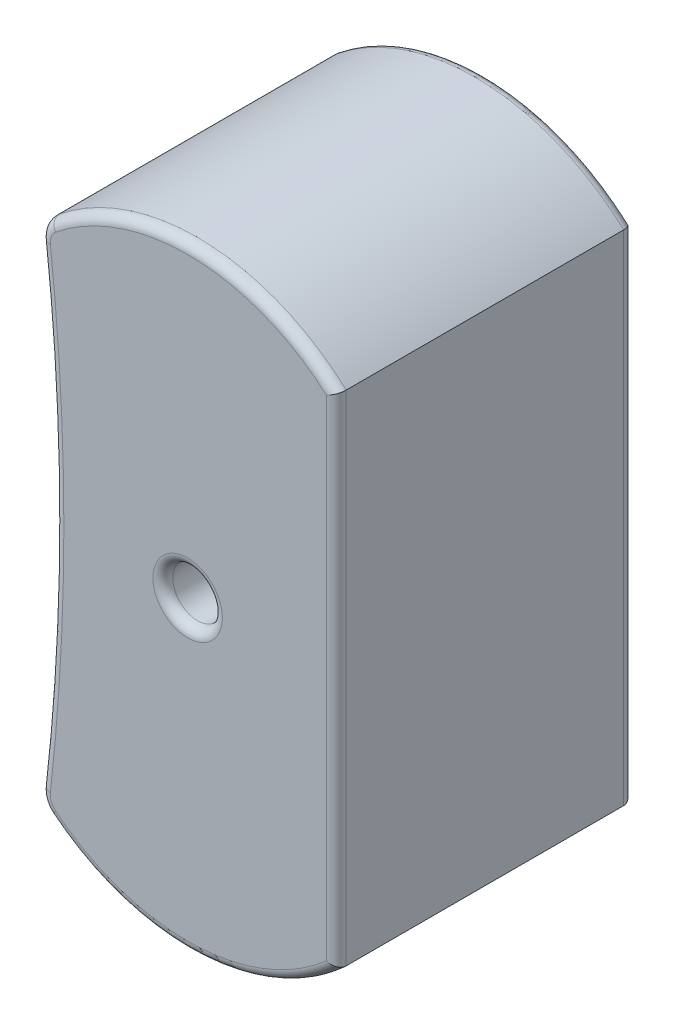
ISO-10303-21;
HEADER;
FILE_DESCRIPTION(('STEP AP214'),'2;1');
FILE_NAME('part.step','',(''),(''),'','','');
FILE_SCHEMA(('AUTOMOTIVE_DESIGN { 1 0 10303 214 1 1 1 1 }'));
ENDSEC;
DATA;
#1=APPLICATION_CONTEXT('core data for automotive mechanical design processes');
#2=APPLICATION_PROTOCOL_DEFINITION('international standard','automotive_design',2000,#1);
#3=PRODUCT_CONTEXT('',#1,'mechanical');
#4=PRODUCT('Part','Part','',(#3));
#5=PRODUCT_RELATED_PRODUCT_CATEGORY('part','',(#4));
#6=PRODUCT_DEFINITION_FORMATION('','',#4);
#7=PRODUCT_DEFINITION_CONTEXT('part definition',#1,'design');
#8=PRODUCT_DEFINITION('design','',#6,#7);
#9=PRODUCT_DEFINITION_SHAPE('','',#8);
#10=(LENGTH_UNIT() NAMED_UNIT(*) SI_UNIT(.MILLI.,.METRE.));
#11=(NAMED_UNIT(*) PLANE_ANGLE_UNIT() SI_UNIT($,.RADIAN.));
#12=(NAMED_UNIT(*) SI_UNIT($,.STERADIAN.) SOLID_ANGLE_UNIT());
#13=UNCERTAINTY_MEASURE_WITH_UNIT(LENGTH_MEASURE(1.E-05),#10,'distance_accuracy_value','');
#14=(GEOMETRIC_REPRESENTATION_CONTEXT(3) GLOBAL_UNCERTAINTY_ASSIGNED_CONTEXT((#13)) GLOBAL_UNIT_ASSIGNED_CONTEXT((#10,
#11,#12)) REPRESENTATION_CONTEXT('',''));
#15=CARTESIAN_POINT('',(0.,0.,0.));
#16=DIRECTION('',(0.,0.,1.));
#17=DIRECTION('',(1.,0.,0.));
#18=AXIS2_PLACEMENT_3D('',#15,#16,#17);
#19=CARTESIAN_POINT('',(1.05498046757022,22.0529480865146,12.));
#20=DIRECTION('',(0.,0.,-1.));
#21=DIRECTION('',(-1.,0.,0.));
#22=AXIS2_PLACEMENT_3D('',#19,#20,#21);
#23=PLANE('',#22);
#24=CARTESIAN_POINT('',(6.,12.4,12.));
#25=DIRECTION('',(0.,0.,-1.));
#26=DIRECTION('',(-1.,0.,0.));
#27=AXIS2_PLACEMENT_3D('',#24,#25,#26);
#28=CIRCLE('',#27,1.4);
#29=CARTESIAN_POINT('',(4.6,12.4,12.));
#30=VERTEX_POINT('',#29);
#31=EDGE_CURVE('E148',#30,#30,#28,.T.);
#32=ORIENTED_EDGE('',*,*,#31,.T.);
#33=EDGE_LOOP('',(#32));
#34=FACE_BOUND('',#33,.T.);
#35=DIRECTION('',(0.,1.,0.));
#36=VECTOR('',#35,1.);
#37=CARTESIAN_POINT('',(11.6,22.0529480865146,12.));
#38=LINE('',#37,#36);
#39=CARTESIAN_POINT('',(11.6,2.51475452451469,12.));
#40=VERTEX_POINT('',#39);
#41=CARTESIAN_POINT('',(11.6,22.2852454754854,12.));
#42=VERTEX_POINT('',#41);
#43=EDGE_CURVE('E146',#40,#42,#38,.T.);
#44=ORIENTED_EDGE('',*,*,#43,.T.);
#45=CARTESIAN_POINT('',(6.,15.9280505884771,12.));
#46=DIRECTION('',(0.,0.,-1.));
#47=DIRECTION('',(-1.,0.,0.));
#48=AXIS2_PLACEMENT_3D('',#45,#46,#47);
#49=CIRCLE('',#48,8.47194941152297);
#50=CARTESIAN_POINT('',(0.678071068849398,22.5197877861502,12.));
#51=VERTEX_POINT('',#50);
#52=EDGE_CURVE('E127',#42,#51,#49,.F.);
#53=ORIENTED_EDGE('',*,*,#52,.T.);
#54=CARTESIAN_POINT('',(1.05498046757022,22.0529480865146,12.));
#55=DIRECTION('',(0.,0.,-1.));
#56=DIRECTION('',(-1.,0.,0.));
#57=AXIS2_PLACEMENT_3D('',#54,#55,#56);
#58=CIRCLE('',#57,0.6);
#59=CARTESIAN_POINT('',(0.458847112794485,21.9849405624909,12.));
#60=VERTEX_POINT('',#59);
#61=EDGE_CURVE('E136',#51,#60,#58,.F.);
#62=ORIENTED_EDGE('',*,*,#61,.T.);
#63=CARTESIAN_POINT('',(-83.5598383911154,12.4,12.));
#64=DIRECTION('',(0.,0.,-1.));
#65=DIRECTION('',(-1.,0.,0.));
#66=AXIS2_PLACEMENT_3D('',#63,#64,#65);
#67=CIRCLE('',#66,84.5636482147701);
#68=CARTESIAN_POINT('',(0.458847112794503,2.81505943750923,12.));
#69=VERTEX_POINT('',#68);
#70=EDGE_CURVE('E142',#60,#69,#67,.T.);
#71=ORIENTED_EDGE('',*,*,#70,.T.);
#72=CARTESIAN_POINT('',(1.05498046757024,2.74705191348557,12.));
#73=DIRECTION('',(0.,0.,-1.));
#74=DIRECTION('',(-1.,0.,0.));
#75=AXIS2_PLACEMENT_3D('',#72,#73,#74);
#76=CIRCLE('',#75,0.6);
#77=CARTESIAN_POINT('',(0.678071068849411,2.28021221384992,12.));
#78=VERTEX_POINT('',#77);
#79=EDGE_CURVE('E354',#69,#78,#76,.F.);
#80=ORIENTED_EDGE('',*,*,#79,.T.);
#81=CARTESIAN_POINT('',(6.,8.87194941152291,12.));
#82=DIRECTION('',(0.,0.,-1.));
#83=DIRECTION('',(-1.,0.,0.));
#84=AXIS2_PLACEMENT_3D('',#81,#82,#83);
#85=CIRCLE('',#84,8.47194941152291);
#86=EDGE_CURVE('E152',#78,#40,#85,.F.);
#87=ORIENTED_EDGE('',*,*,#86,.T.);
#88=EDGE_LOOP('',(#44,#53,#62,#71,#80,#87));
#89=FACE_BOUND('',#88,.T.);
#90=ADVANCED_FACE('F32',(#34,#89),#23,.F.);
#91=CARTESIAN_POINT('',(1.05498046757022,22.0529480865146,0.));
#92=DIRECTION('',(0.,0.,-1.));
#93=DIRECTION('',(-1.,0.,0.));
#94=AXIS2_PLACEMENT_3D('',#91,#92,#93);
#95=PLANE('',#94);
#96=CARTESIAN_POINT('',(6.,12.4,0.));
#97=DIRECTION('',(0.,0.,-1.));
#98=DIRECTION('',(-1.,0.,0.));
#99=AXIS2_PLACEMENT_3D('',#96,#97,#98);
#100=CIRCLE('',#99,1.4);
#101=CARTESIAN_POINT('',(4.6,12.4,0.));
#102=VERTEX_POINT('',#101);
#103=EDGE_CURVE('E180',#102,#102,#100,.F.);
#104=ORIENTED_EDGE('',*,*,#103,.T.);
#105=EDGE_LOOP('',(#104));
#106=FACE_BOUND('',#105,.T.);
#107=CARTESIAN_POINT('',(1.05498046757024,2.74705191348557,0.));
#108=DIRECTION('',(0.,0.,-1.));
#109=DIRECTION('',(-1.,0.,0.));
#110=AXIS2_PLACEMENT_3D('',#107,#108,#109);
#111=CIRCLE('',#110,0.6);
#112=CARTESIAN_POINT('',(0.678071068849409,2.28021221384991,0.));
#113=VERTEX_POINT('',#112);
#114=CARTESIAN_POINT('',(0.458847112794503,2.81505943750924,0.));
#115=VERTEX_POINT('',#114);
#116=EDGE_CURVE('E175',#113,#115,#111,.T.);
#117=ORIENTED_EDGE('',*,*,#116,.T.);
#118=CARTESIAN_POINT('',(-83.5598383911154,12.4,0.));
#119=DIRECTION('',(0.,0.,-1.));
#120=DIRECTION('',(-1.,0.,0.));
#121=AXIS2_PLACEMENT_3D('',#118,#119,#120);
#122=CIRCLE('',#121,84.5636482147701);
#123=CARTESIAN_POINT('',(0.458847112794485,21.9849405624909,0.));
#124=VERTEX_POINT('',#123);
#125=EDGE_CURVE('E177',#115,#124,#122,.F.);
#126=ORIENTED_EDGE('',*,*,#125,.T.);
#127=CARTESIAN_POINT('',(1.05498046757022,22.0529480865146,0.));
#128=DIRECTION('',(0.,0.,-1.));
#129=DIRECTION('',(-1.,0.,0.));
#130=AXIS2_PLACEMENT_3D('',#127,#128,#129);
#131=CIRCLE('',#130,0.6);
#132=CARTESIAN_POINT('',(0.678071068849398,22.5197877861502,0.));
#133=VERTEX_POINT('',#132);
#134=EDGE_CURVE('E167',#124,#133,#131,.T.);
#135=ORIENTED_EDGE('',*,*,#134,.T.);
#136=CARTESIAN_POINT('',(6.,15.9280505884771,0.));
#137=DIRECTION('',(0.,0.,-1.));
#138=DIRECTION('',(-1.,0.,0.));
#139=AXIS2_PLACEMENT_3D('',#136,#137,#138);
#140=CIRCLE('',#139,8.47194941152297);
#141=CARTESIAN_POINT('',(11.6,22.2852454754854,0.));
#142=VERTEX_POINT('',#141);
#143=EDGE_CURVE('E169',#133,#142,#140,.T.);
#144=ORIENTED_EDGE('',*,*,#143,.T.);
#145=DIRECTION('',(0.,1.,0.));
#146=VECTOR('',#145,1.);
#147=CARTESIAN_POINT('',(11.6,2.33654687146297,0.));
#148=LINE('',#147,#146);
#149=CARTESIAN_POINT('',(11.6,2.51475452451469,0.));
#150=VERTEX_POINT('',#149);
#151=EDGE_CURVE('E171',#142,#150,#148,.F.);
#152=ORIENTED_EDGE('',*,*,#151,.T.);
#153=CARTESIAN_POINT('',(6.,8.87194941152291,0.));
#154=DIRECTION('',(0.,0.,-1.));
#155=DIRECTION('',(-1.,0.,0.));
#156=AXIS2_PLACEMENT_3D('',#153,#154,#155);
#157=CIRCLE('',#156,8.47194941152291);
#158=EDGE_CURVE('E173',#150,#113,#157,.T.);
#159=ORIENTED_EDGE('',*,*,#158,.T.);
#160=EDGE_LOOP('',(#117,#126,#135,#144,#152,#159));
#161=FACE_BOUND('',#160,.T.);
#162=ADVANCED_FACE('F298',(#106,#161),#95,.T.);
#163=CARTESIAN_POINT('',(1.05498046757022,22.0529480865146,12.));
#164=DIRECTION('',(0.,0.,-1.));
#165=DIRECTION('',(-1.,0.,0.));
#166=AXIS2_PLACEMENT_3D('',#163,#164,#165);
#167=CYLINDRICAL_SURFACE('',#166,1.);
#168=DIRECTION('',(0.,0.,-1.));
#169=VECTOR('',#168,1.);
#170=CARTESIAN_POINT('',(0.426798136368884,22.8310142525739,12.));
#171=LINE('',#170,#169);
#172=CARTESIAN_POINT('',(0.426798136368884,22.8310142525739,11.6));
#173=VERTEX_POINT('',#172);
#174=CARTESIAN_POINT('',(0.426798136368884,22.8310142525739,0.399999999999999));
#175=VERTEX_POINT('',#174);
#176=EDGE_CURVE('E360',#173,#175,#171,.T.);
#177=ORIENTED_EDGE('',*,*,#176,.T.);
#178=CARTESIAN_POINT('',(1.05498046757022,22.0529480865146,0.399999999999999));
#179=DIRECTION('',(0.,0.,-1.));
#180=DIRECTION('',(-1.,0.,0.));
#181=AXIS2_PLACEMENT_3D('',#178,#179,#180);
#182=CIRCLE('',#181,1.);
#183=CARTESIAN_POINT('',(0.0614248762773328,21.9396022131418,0.399999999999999));
#184=VERTEX_POINT('',#183);
#185=EDGE_CURVE('E11',#175,#184,#182,.F.);
#186=ORIENTED_EDGE('',*,*,#185,.T.);
#187=DIRECTION('',(0.,0.,-1.));
#188=VECTOR('',#187,1.);
#189=CARTESIAN_POINT('',(0.0614248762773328,21.9396022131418,12.));
#190=LINE('',#189,#188);
#191=CARTESIAN_POINT('',(0.0614248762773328,21.9396022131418,11.6));
#192=VERTEX_POINT('',#191);
#193=EDGE_CURVE('E323',#192,#184,#190,.T.);
#194=ORIENTED_EDGE('',*,*,#193,.F.);
#195=CARTESIAN_POINT('',(1.05498046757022,22.0529480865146,11.6));
#196=DIRECTION('',(0.,0.,-1.));
#197=DIRECTION('',(-1.,0.,0.));
#198=AXIS2_PLACEMENT_3D('',#195,#196,#197);
#199=CIRCLE('',#198,1.);
#200=EDGE_CURVE('E165',#192,#173,#199,.T.);
#201=ORIENTED_EDGE('',*,*,#200,.T.);
#202=EDGE_LOOP('',(#177,#186,#194,#201));
#203=FACE_BOUND('',#202,.T.);
#204=ADVANCED_FACE('F34',(#203),#167,.T.);
#205=CARTESIAN_POINT('',(-83.5598383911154,12.4,12.));
#206=DIRECTION('',(0.,0.,-1.));
#207=DIRECTION('',(-1.,0.,0.));
#208=AXIS2_PLACEMENT_3D('',#205,#206,#207);
#209=CYLINDRICAL_SURFACE('',#208,84.1636482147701);
#210=ORIENTED_EDGE('',*,*,#193,.T.);
#211=CARTESIAN_POINT('',(-83.5598383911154,12.4,0.399999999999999));
#212=DIRECTION('',(0.,0.,-1.));
#213=DIRECTION('',(-1.,0.,0.));
#214=AXIS2_PLACEMENT_3D('',#211,#212,#213);
#215=CIRCLE('',#214,84.1636482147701);
#216=CARTESIAN_POINT('',(0.0614248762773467,2.86039778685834,0.399999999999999));
#217=VERTEX_POINT('',#216);
#218=EDGE_CURVE('E186',#184,#217,#215,.T.);
#219=ORIENTED_EDGE('',*,*,#218,.T.);
#220=DIRECTION('',(0.,0.,-1.));
#221=VECTOR('',#220,1.);
#222=CARTESIAN_POINT('',(0.0614248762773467,2.86039778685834,12.));
#223=LINE('',#222,#221);
#224=CARTESIAN_POINT('',(0.0614248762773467,2.86039778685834,11.6));
#225=VERTEX_POINT('',#224);
#226=EDGE_CURVE('E329',#225,#217,#223,.T.);
#227=ORIENTED_EDGE('',*,*,#226,.F.);
#228=CARTESIAN_POINT('',(-83.5598383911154,12.4,11.6));
#229=DIRECTION('',(0.,0.,-1.));
#230=DIRECTION('',(-1.,0.,0.));
#231=AXIS2_PLACEMENT_3D('',#228,#229,#230);
#232=CIRCLE('',#231,84.1636482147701);
#233=EDGE_CURVE('E163',#225,#192,#232,.F.);
#234=ORIENTED_EDGE('',*,*,#233,.T.);
#235=EDGE_LOOP('',(#210,#219,#227,#234));
#236=FACE_BOUND('',#235,.T.);
#237=ADVANCED_FACE('F313',(#236),#209,.F.);
#238=CARTESIAN_POINT('',(1.05498046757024,2.74705191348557,12.));
#239=DIRECTION('',(0.,0.,-1.));
#240=DIRECTION('',(-1.,0.,0.));
#241=AXIS2_PLACEMENT_3D('',#238,#239,#240);
#242=CYLINDRICAL_SURFACE('',#241,1.);
#243=ORIENTED_EDGE('',*,*,#226,.T.);
#244=CARTESIAN_POINT('',(1.05498046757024,2.74705191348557,0.399999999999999));
#245=DIRECTION('',(0.,0.,-1.));
#246=DIRECTION('',(-1.,0.,0.));
#247=AXIS2_PLACEMENT_3D('',#244,#245,#246);
#248=CIRCLE('',#247,1.);
#249=CARTESIAN_POINT('',(0.426798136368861,1.96898574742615,0.399999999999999));
#250=VERTEX_POINT('',#249);
#251=EDGE_CURVE('E189',#217,#250,#248,.F.);
#252=ORIENTED_EDGE('',*,*,#251,.T.);
#253=DIRECTION('',(0.,0.,-1.));
#254=VECTOR('',#253,1.);
#255=CARTESIAN_POINT('',(0.426798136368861,1.96898574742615,12.));
#256=LINE('',#255,#254);
#257=CARTESIAN_POINT('',(0.426798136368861,1.96898574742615,11.6));
#258=VERTEX_POINT('',#257);
#259=EDGE_CURVE('E201',#258,#250,#256,.T.);
#260=ORIENTED_EDGE('',*,*,#259,.F.);
#261=CARTESIAN_POINT('',(1.05498046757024,2.74705191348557,11.6));
#262=DIRECTION('',(0.,0.,-1.));
#263=DIRECTION('',(-1.,0.,0.));
#264=AXIS2_PLACEMENT_3D('',#261,#262,#263);
#265=CIRCLE('',#264,1.);
#266=EDGE_CURVE('E161',#258,#225,#265,.T.);
#267=ORIENTED_EDGE('',*,*,#266,.T.);
#268=EDGE_LOOP('',(#243,#252,#260,#267));
#269=FACE_BOUND('',#268,.T.);
#270=ADVANCED_FACE('F311',(#269),#242,.T.);
#271=CARTESIAN_POINT('',(6.,8.87194941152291,12.));
#272=DIRECTION('',(0.,0.,-1.));
#273=DIRECTION('',(-1.,0.,0.));
#274=AXIS2_PLACEMENT_3D('',#271,#272,#273);
#275=CYLINDRICAL_SURFACE('',#274,8.87194941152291);
#276=ORIENTED_EDGE('',*,*,#259,.T.);
#277=CARTESIAN_POINT('',(6.,8.87194941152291,0.399999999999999));
#278=DIRECTION('',(0.,0.,-1.));
#279=DIRECTION('',(-1.,0.,0.));
#280=AXIS2_PLACEMENT_3D('',#277,#278,#279);
#281=CIRCLE('',#280,8.87194941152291);
#282=CARTESIAN_POINT('',(12.,2.33654687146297,0.400000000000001));
#283=VERTEX_POINT('',#282);
#284=EDGE_CURVE('E191',#250,#283,#281,.F.);
#285=ORIENTED_EDGE('',*,*,#284,.T.);
#286=DIRECTION('',(0.,0.,-1.));
#287=VECTOR('',#286,1.);
#288=CARTESIAN_POINT('',(12.,2.33654687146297,12.));
#289=LINE('',#288,#287);
#290=CARTESIAN_POINT('',(12.,2.33654687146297,11.6));
#291=VERTEX_POINT('',#290);
#292=EDGE_CURVE('E198',#291,#283,#289,.T.);
#293=ORIENTED_EDGE('',*,*,#292,.F.);
#294=CARTESIAN_POINT('',(6.,8.87194941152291,11.6));
#295=DIRECTION('',(0.,0.,-1.));
#296=DIRECTION('',(-1.,0.,0.));
#297=AXIS2_PLACEMENT_3D('',#294,#295,#296);
#298=CIRCLE('',#297,8.87194941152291);
#299=EDGE_CURVE('E159',#291,#258,#298,.T.);
#300=ORIENTED_EDGE('',*,*,#299,.T.);
#301=EDGE_LOOP('',(#276,#285,#293,#300));
#302=FACE_BOUND('',#301,.T.);
#303=ADVANCED_FACE('F197',(#302),#275,.T.);
#304=CARTESIAN_POINT('',(12.,2.33654687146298,12.));
#305=DIRECTION('',(-1.,0.,0.));
#306=DIRECTION('',(0.,0.,1.));
#307=AXIS2_PLACEMENT_3D('',#304,#305,#306);
#308=PLANE('',#307);
#309=ORIENTED_EDGE('',*,*,#292,.T.);
#310=DIRECTION('',(0.,1.,0.));
#311=VECTOR('',#310,1.);
#312=CARTESIAN_POINT('',(12.,22.463453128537,0.399999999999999));
#313=LINE('',#312,#311);
#314=CARTESIAN_POINT('',(12.,22.463453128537,0.400000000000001));
#315=VERTEX_POINT('',#314);
#316=EDGE_CURVE('E54',#283,#315,#313,.T.);
#317=ORIENTED_EDGE('',*,*,#316,.T.);
#318=DIRECTION('',(0.,0.,-1.));
#319=VECTOR('',#318,1.);
#320=CARTESIAN_POINT('',(12.,22.463453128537,12.));
#321=LINE('',#320,#319);
#322=CARTESIAN_POINT('',(12.,22.463453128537,11.6));
#323=VERTEX_POINT('',#322);
#324=EDGE_CURVE('E208',#323,#315,#321,.T.);
#325=ORIENTED_EDGE('',*,*,#324,.F.);
#326=DIRECTION('',(0.,1.,0.));
#327=VECTOR('',#326,1.);
#328=CARTESIAN_POINT('',(12.,2.33654687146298,11.6));
#329=LINE('',#328,#327);
#330=EDGE_CURVE('E157',#323,#291,#329,.F.);
#331=ORIENTED_EDGE('',*,*,#330,.T.);
#332=EDGE_LOOP('',(#309,#317,#325,#331));
#333=FACE_BOUND('',#332,.T.);
#334=ADVANCED_FACE('F206',(#333),#308,.F.);
#335=CARTESIAN_POINT('',(6.,15.9280505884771,12.));
#336=DIRECTION('',(0.,0.,-1.));
#337=DIRECTION('',(-1.,0.,0.));
#338=AXIS2_PLACEMENT_3D('',#335,#336,#337);
#339=CYLINDRICAL_SURFACE('',#338,8.87194941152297);
#340=ORIENTED_EDGE('',*,*,#324,.T.);
#341=CARTESIAN_POINT('',(6.,15.9280505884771,0.399999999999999));
#342=DIRECTION('',(0.,0.,-1.));
#343=DIRECTION('',(-1.,0.,0.));
#344=AXIS2_PLACEMENT_3D('',#341,#342,#343);
#345=CIRCLE('',#344,8.87194941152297);
#346=EDGE_CURVE('E40',#315,#175,#345,.F.);
#347=ORIENTED_EDGE('',*,*,#346,.T.);
#348=ORIENTED_EDGE('',*,*,#176,.F.);
#349=CARTESIAN_POINT('',(6.,15.9280505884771,11.6));
#350=DIRECTION('',(0.,0.,-1.));
#351=DIRECTION('',(-1.,0.,0.));
#352=AXIS2_PLACEMENT_3D('',#349,#350,#351);
#353=CIRCLE('',#352,8.87194941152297);
#354=EDGE_CURVE('E129',#173,#323,#353,.T.);
#355=ORIENTED_EDGE('',*,*,#354,.T.);
#356=EDGE_LOOP('',(#340,#347,#348,#355));
#357=FACE_BOUND('',#356,.T.);
#358=ADVANCED_FACE('F296',(#357),#339,.T.);
#359=CARTESIAN_POINT('',(6.,12.4,12.));
#360=DIRECTION('',(0.,0.,-1.));
#361=DIRECTION('',(-1.,0.,0.));
#362=AXIS2_PLACEMENT_3D('',#359,#360,#361);
#363=CYLINDRICAL_SURFACE('',#362,1.);
#364=CARTESIAN_POINT('',(6.,12.4,0.399999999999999));
#365=DIRECTION('',(0.,0.,-1.));
#366=DIRECTION('',(-1.,0.,0.));
#367=AXIS2_PLACEMENT_3D('',#364,#365,#366);
#368=CIRCLE('',#367,1.);
#369=CARTESIAN_POINT('',(5.,12.4,0.399999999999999));
#370=VERTEX_POINT('',#369);
#371=EDGE_CURVE('E183',#370,#370,#368,.T.);
#372=ORIENTED_EDGE('',*,*,#371,.T.);
#373=EDGE_LOOP('',(#372));
#374=FACE_BOUND('',#373,.T.);
#375=CARTESIAN_POINT('',(6.,12.4,11.6));
#376=DIRECTION('',(0.,0.,-1.));
#377=DIRECTION('',(-1.,0.,0.));
#378=AXIS2_PLACEMENT_3D('',#375,#376,#377);
#379=CIRCLE('',#378,1.);
#380=CARTESIAN_POINT('',(5.,12.4,11.6));
#381=VERTEX_POINT('',#380);
#382=EDGE_CURVE('E143',#381,#381,#379,.F.);
#383=ORIENTED_EDGE('',*,*,#382,.T.);
#384=EDGE_LOOP('',(#383));
#385=FACE_BOUND('',#384,.T.);
#386=ADVANCED_FACE('F292',(#374,#385),#363,.F.);
#387=CARTESIAN_POINT('',(6.,12.4,11.6));
#388=DIRECTION('',(0.,0.,-1.));
#389=DIRECTION('',(-1.,0.,0.));
#390=AXIS2_PLACEMENT_3D('',#387,#388,#389);
#391=TOROIDAL_SURFACE('',#390,1.4,0.4);
#392=ORIENTED_EDGE('',*,*,#31,.F.);
#393=EDGE_LOOP('',(#392));
#394=FACE_BOUND('',#393,.T.);
#395=ORIENTED_EDGE('',*,*,#382,.F.);
#396=EDGE_LOOP('',(#395));
#397=FACE_BOUND('',#396,.T.);
#398=ADVANCED_FACE('F288',(#394,#397),#391,.T.);
#399=CARTESIAN_POINT('',(1.05498046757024,2.74705191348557,11.6));
#400=DIRECTION('',(0.,0.,-1.));
#401=DIRECTION('',(-1.,0.,0.));
#402=AXIS2_PLACEMENT_3D('',#399,#400,#401);
#403=TOROIDAL_SURFACE('',#402,0.6,0.4);
#404=CARTESIAN_POINT('',(0.458847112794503,2.81505943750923,11.6));
#405=DIRECTION('',(0.113345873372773,0.99355559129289,0.));
#406=DIRECTION('',(-0.99355559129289,0.113345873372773,0.));
#407=AXIS2_PLACEMENT_3D('',#404,#405,#406);
#408=CIRCLE('',#407,0.4);
#409=EDGE_CURVE('E275',#225,#69,#408,.T.);
#410=ORIENTED_EDGE('',*,*,#409,.F.);
#411=ORIENTED_EDGE('',*,*,#266,.F.);
#412=CARTESIAN_POINT('',(0.678071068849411,2.28021221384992,11.6));
#413=DIRECTION('',(0.77806616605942,-0.628182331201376,0.));
#414=DIRECTION('',(0.628182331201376,0.77806616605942,0.));
#415=AXIS2_PLACEMENT_3D('',#412,#413,#414);
#416=CIRCLE('',#415,0.4);
#417=EDGE_CURVE('E362',#78,#258,#416,.T.);
#418=ORIENTED_EDGE('',*,*,#417,.F.);
#419=ORIENTED_EDGE('',*,*,#79,.F.);
#420=EDGE_LOOP('',(#410,#411,#418,#419));
#421=FACE_BOUND('',#420,.T.);
#422=ADVANCED_FACE('F281',(#421),#403,.T.);
#423=CARTESIAN_POINT('',(6.,8.87194941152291,11.6));
#424=DIRECTION('',(0.,0.,-1.));
#425=DIRECTION('',(-1.,0.,0.));
#426=AXIS2_PLACEMENT_3D('',#423,#424,#425);
#427=TOROIDAL_SURFACE('',#426,8.47194941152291,0.4);
#428=ORIENTED_EDGE('',*,*,#417,.T.);
#429=ORIENTED_EDGE('',*,*,#299,.F.);
#430=CARTESIAN_POINT('',(12.,2.33654687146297,11.6));
#431=CARTESIAN_POINT('',(12.000024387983,2.33653663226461,11.621129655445));
#432=CARTESIAN_POINT('',(11.998327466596,2.33728186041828,11.6422428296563));
#433=CARTESIAN_POINT('',(11.991682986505,2.34020247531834,11.6837870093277));
#434=CARTESIAN_POINT('',(11.9867451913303,2.34237356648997,11.7042198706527));
#435=CARTESIAN_POINT('',(11.97381107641,2.34806503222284,11.7438812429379));
#436=CARTESIAN_POINT('',(11.9658157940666,2.35158494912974,11.7631101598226));
#437=CARTESIAN_POINT('',(11.947082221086,2.35984152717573,11.799900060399));
#438=CARTESIAN_POINT('',(11.9363427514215,2.3645787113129,11.8174603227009));
#439=CARTESIAN_POINT('',(11.912089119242,2.3752914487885,11.8510870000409));
#440=CARTESIAN_POINT('',(11.8984933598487,2.38130348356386,11.8670827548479));
#441=CARTESIAN_POINT('',(11.8692099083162,2.39427364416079,11.8965776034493));
#442=CARTESIAN_POINT('',(11.8535215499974,2.40123207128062,11.9100758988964));
#443=CARTESIAN_POINT('',(11.8191716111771,2.41649519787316,11.9353416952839));
#444=CARTESIAN_POINT('',(11.8003725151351,2.42486309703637,11.9468838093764));
#445=CARTESIAN_POINT('',(11.7613810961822,2.4422558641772,11.9666526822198));
#446=CARTESIAN_POINT('',(11.7411881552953,2.451281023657,11.9748779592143));
#447=CARTESIAN_POINT('',(11.7016416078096,2.4689955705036,11.9873797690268));
#448=CARTESIAN_POINT('',(11.6823570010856,2.47765085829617,11.9919269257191));
#449=CARTESIAN_POINT('',(11.6434447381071,2.49515199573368,11.9981198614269));
#450=CARTESIAN_POINT('',(11.6238178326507,2.50399743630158,11.9997713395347));
#451=CARTESIAN_POINT('',(11.6028053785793,2.51348725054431,11.9999926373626));
#452=CARTESIAN_POINT('',(11.6014026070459,2.51412087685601,12.000000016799));
#453=CARTESIAN_POINT('',(11.6,2.51475452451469,12.));
#454=B_SPLINE_CURVE_WITH_KNOTS('',3,(#430,#431,#432,#433,#434,#435,#436,#437,#438,#439,#440,
#441,#442,#443,#444,#445,#446,#447,#448,#449,#450,#451,#452,#453),.UNSPECIFIED.,.F.,.F.,(4,2,2,
2,2,2,2,2,2,2,2,4),(0.,0.0632822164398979,0.126374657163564,0.189445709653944,0.252543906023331,
0.317777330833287,0.383031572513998,0.45351510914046,0.524030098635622,0.588704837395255,
0.653252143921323,0.657869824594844),.UNSPECIFIED.);
#455=EDGE_CURVE('E267',#40,#291,#454,.F.);
#456=ORIENTED_EDGE('',*,*,#455,.F.);
#457=ORIENTED_EDGE('',*,*,#86,.F.);
#458=EDGE_LOOP('',(#428,#429,#456,#457));
#459=FACE_BOUND('',#458,.T.);
#460=ADVANCED_FACE('F277',(#459),#427,.T.);
#461=CARTESIAN_POINT('',(-83.5598383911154,12.4,11.6));
#462=DIRECTION('',(0.,0.,-1.));
#463=DIRECTION('',(-1.,0.,0.));
#464=AXIS2_PLACEMENT_3D('',#461,#462,#463);
#465=TOROIDAL_SURFACE('',#464,84.5636482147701,0.4);
#466=ORIENTED_EDGE('',*,*,#409,.T.);
#467=ORIENTED_EDGE('',*,*,#70,.F.);
#468=CARTESIAN_POINT('',(0.458847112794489,21.9849405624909,11.6));
#469=DIRECTION('',(-0.113345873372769,0.99355559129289,0.));
#470=DIRECTION('',(-0.99355559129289,-0.113345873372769,0.));
#471=AXIS2_PLACEMENT_3D('',#468,#469,#470);
#472=CIRCLE('',#471,0.4);
#473=EDGE_CURVE('E139',#192,#60,#472,.T.);
#474=ORIENTED_EDGE('',*,*,#473,.F.);
#475=ORIENTED_EDGE('',*,*,#233,.F.);
#476=EDGE_LOOP('',(#466,#467,#474,#475));
#477=FACE_BOUND('',#476,.T.);
#478=ADVANCED_FACE('F255',(#477),#465,.T.);
#479=CARTESIAN_POINT('',(11.6,22.0529480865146,11.6));
#480=DIRECTION('',(0.,1.,0.));
#481=DIRECTION('',(0.,0.,1.));
#482=AXIS2_PLACEMENT_3D('',#479,#480,#481);
#483=CYLINDRICAL_SURFACE('',#482,0.4);
#484=ORIENTED_EDGE('',*,*,#455,.T.);
#485=ORIENTED_EDGE('',*,*,#330,.F.);
#486=CARTESIAN_POINT('',(12.,22.463453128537,11.6));
#487=CARTESIAN_POINT('',(12.000024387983,22.4634633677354,11.621129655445));
#488=CARTESIAN_POINT('',(11.998327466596,22.4627181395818,11.6422428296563));
#489=CARTESIAN_POINT('',(11.991682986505,22.4597975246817,11.6837870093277));
#490=CARTESIAN_POINT('',(11.9867451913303,22.4576264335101,11.7042198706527));
#491=CARTESIAN_POINT('',(11.97381107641,22.4519349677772,11.7438812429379));
#492=CARTESIAN_POINT('',(11.9658157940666,22.4484150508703,11.7631101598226));
#493=CARTESIAN_POINT('',(11.947082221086,22.4401584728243,11.799900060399));
#494=CARTESIAN_POINT('',(11.9363427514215,22.4354212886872,11.8174603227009));
#495=CARTESIAN_POINT('',(11.912089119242,22.4247085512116,11.8510870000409));
#496=CARTESIAN_POINT('',(11.8984933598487,22.4186965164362,11.8670827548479));
#497=CARTESIAN_POINT('',(11.8692099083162,22.4057263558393,11.8965776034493));
#498=CARTESIAN_POINT('',(11.8535215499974,22.3987679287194,11.9100758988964));
#499=CARTESIAN_POINT('',(11.8191716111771,22.3835048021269,11.9353416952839));
#500=CARTESIAN_POINT('',(11.8003725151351,22.3751369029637,11.9468838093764));
#501=CARTESIAN_POINT('',(11.7613810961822,22.3577441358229,11.9666526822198));
#502=CARTESIAN_POINT('',(11.7411881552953,22.3487189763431,11.9748779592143));
#503=CARTESIAN_POINT('',(11.7016416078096,22.3310044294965,11.9873797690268));
#504=CARTESIAN_POINT('',(11.6823570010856,22.3223491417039,11.9919269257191));
#505=CARTESIAN_POINT('',(11.6434447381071,22.3048480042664,11.9981198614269));
#506=CARTESIAN_POINT('',(11.6238178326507,22.2960025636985,11.9997713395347));
#507=CARTESIAN_POINT('',(11.6028053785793,22.2865127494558,11.9999926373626));
#508=CARTESIAN_POINT('',(11.6014026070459,22.285879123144,12.000000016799));
#509=CARTESIAN_POINT('',(11.6,22.2852454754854,12.));
#510=B_SPLINE_CURVE_WITH_KNOTS('',3,(#486,#487,#488,#489,#490,#491,#492,#493,#494,#495,#496,
#497,#498,#499,#500,#501,#502,#503,#504,#505,#506,#507,#508,#509),.UNSPECIFIED.,.F.,.F.,(4,2,2,
2,2,2,2,2,2,2,2,4),(0.,0.0632822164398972,0.126374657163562,0.189445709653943,0.252543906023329,
0.317777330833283,0.383031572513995,0.453515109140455,0.524030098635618,0.588704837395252,
0.65325214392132,0.657869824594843),.UNSPECIFIED.);
#511=EDGE_CURVE('E132',#42,#323,#510,.F.);
#512=ORIENTED_EDGE('',*,*,#511,.F.);
#513=ORIENTED_EDGE('',*,*,#43,.F.);
#514=EDGE_LOOP('',(#484,#485,#512,#513));
#515=FACE_BOUND('',#514,.T.);
#516=ADVANCED_FACE('F251',(#515),#483,.T.);
#517=CARTESIAN_POINT('',(1.05498046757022,22.0529480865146,11.6));
#518=DIRECTION('',(0.,0.,-1.));
#519=DIRECTION('',(-1.,0.,0.));
#520=AXIS2_PLACEMENT_3D('',#517,#518,#519);
#521=TOROIDAL_SURFACE('',#520,0.6,0.4);
#522=ORIENTED_EDGE('',*,*,#473,.T.);
#523=ORIENTED_EDGE('',*,*,#61,.F.);
#524=CARTESIAN_POINT('',(0.678071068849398,22.5197877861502,11.6));
#525=DIRECTION('',(0.778066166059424,0.628182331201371,0.));
#526=DIRECTION('',(-0.628182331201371,0.778066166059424,0.));
#527=AXIS2_PLACEMENT_3D('',#524,#525,#526);
#528=CIRCLE('',#527,0.4);
#529=EDGE_CURVE('E123',#173,#51,#528,.T.);
#530=ORIENTED_EDGE('',*,*,#529,.F.);
#531=ORIENTED_EDGE('',*,*,#200,.F.);
#532=EDGE_LOOP('',(#522,#523,#530,#531));
#533=FACE_BOUND('',#532,.T.);
#534=ADVANCED_FACE('F137',(#533),#521,.T.);
#535=CARTESIAN_POINT('',(6.,15.9280505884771,11.6));
#536=DIRECTION('',(0.,0.,-1.));
#537=DIRECTION('',(-1.,0.,0.));
#538=AXIS2_PLACEMENT_3D('',#535,#536,#537);
#539=TOROIDAL_SURFACE('',#538,8.47194941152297,0.4);
#540=ORIENTED_EDGE('',*,*,#511,.T.);
#541=ORIENTED_EDGE('',*,*,#354,.F.);
#542=ORIENTED_EDGE('',*,*,#529,.T.);
#543=ORIENTED_EDGE('',*,*,#52,.F.);
#544=EDGE_LOOP('',(#540,#541,#542,#543));
#545=FACE_BOUND('',#544,.T.);
#546=ADVANCED_FACE('F125',(#545),#539,.T.);
#547=CARTESIAN_POINT('',(6.,12.4,0.399999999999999));
#548=DIRECTION('',(0.,0.,-1.));
#549=DIRECTION('',(-1.,0.,0.));
#550=AXIS2_PLACEMENT_3D('',#547,#548,#549);
#551=TOROIDAL_SURFACE('',#550,1.4,0.4);
#552=ORIENTED_EDGE('',*,*,#371,.F.);
#553=EDGE_LOOP('',(#552));
#554=FACE_BOUND('',#553,.T.);
#555=ORIENTED_EDGE('',*,*,#103,.F.);
#556=EDGE_LOOP('',(#555));
#557=FACE_BOUND('',#556,.T.);
#558=ADVANCED_FACE('F247',(#554,#557),#551,.T.);
#559=CARTESIAN_POINT('',(11.6,2.33654687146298,0.399999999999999));
#560=DIRECTION('',(0.,-1.,0.));
#561=DIRECTION('',(0.,0.,-1.));
#562=AXIS2_PLACEMENT_3D('',#559,#560,#561);
#563=CYLINDRICAL_SURFACE('',#562,0.4);
#564=CARTESIAN_POINT('',(12.,2.33654687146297,0.4));
#565=CARTESIAN_POINT('',(12.000024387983,2.33653663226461,0.378870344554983));
#566=CARTESIAN_POINT('',(11.998327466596,2.33728186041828,0.357757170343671));
#567=CARTESIAN_POINT('',(11.991682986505,2.34020247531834,0.316212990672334));
#568=CARTESIAN_POINT('',(11.9867451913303,2.34237356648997,0.2957801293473));
#569=CARTESIAN_POINT('',(11.97381107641,2.34806503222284,0.256118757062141));
#570=CARTESIAN_POINT('',(11.9658157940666,2.35158494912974,0.236889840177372));
#571=CARTESIAN_POINT('',(11.947082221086,2.35984152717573,0.200099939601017));
#572=CARTESIAN_POINT('',(11.9363427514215,2.3645787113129,0.182539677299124));
#573=CARTESIAN_POINT('',(11.912089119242,2.3752914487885,0.148912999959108));
#574=CARTESIAN_POINT('',(11.8984933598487,2.38130348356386,0.132917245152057));
#575=CARTESIAN_POINT('',(11.8692099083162,2.39427364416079,0.103422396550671));
#576=CARTESIAN_POINT('',(11.8535215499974,2.40123207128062,0.0899241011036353));
#577=CARTESIAN_POINT('',(11.8191716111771,2.41649519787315,0.0646583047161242));
#578=CARTESIAN_POINT('',(11.8003725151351,2.42486309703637,0.0531161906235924));
#579=CARTESIAN_POINT('',(11.7613810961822,2.4422558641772,0.0333473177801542));
#580=CARTESIAN_POINT('',(11.7411881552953,2.451281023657,0.0251220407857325));
#581=CARTESIAN_POINT('',(11.7016416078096,2.4689955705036,0.0126202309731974));
#582=CARTESIAN_POINT('',(11.6823570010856,2.47765085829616,0.00807307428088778));
#583=CARTESIAN_POINT('',(11.6434447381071,2.49515199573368,0.0018801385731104));
#584=CARTESIAN_POINT('',(11.6238178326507,2.50399743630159,0.00022866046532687));
#585=CARTESIAN_POINT('',(11.6028053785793,2.51348725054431,7.36263737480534E-06));
#586=CARTESIAN_POINT('',(11.6014026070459,2.51412087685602,-1.67989969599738E-08));
#587=CARTESIAN_POINT('',(11.6,2.51475452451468,0.));
#588=B_SPLINE_CURVE_WITH_KNOTS('',3,(#564,#565,#566,#567,#568,#569,#570,#571,#572,#573,#574,
#575,#576,#577,#578,#579,#580,#581,#582,#583,#584,#585,#586,#587),.UNSPECIFIED.,.F.,.F.,(4,2,2,
2,2,2,2,2,2,2,2,4),(0.,0.0632822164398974,0.126374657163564,0.189445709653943,0.252543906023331,
0.317777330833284,0.383031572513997,0.453515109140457,0.524030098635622,0.588704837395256,
0.653252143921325,0.657869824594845),.UNSPECIFIED.);
#589=EDGE_CURVE('E215',#150,#283,#588,.F.);
#590=ORIENTED_EDGE('',*,*,#589,.F.);
#591=ORIENTED_EDGE('',*,*,#151,.F.);
#592=CARTESIAN_POINT('',(12.,22.463453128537,0.4));
#593=CARTESIAN_POINT('',(12.000024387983,22.4634633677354,0.378870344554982));
#594=CARTESIAN_POINT('',(11.998327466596,22.4627181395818,0.357757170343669));
#595=CARTESIAN_POINT('',(11.991682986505,22.4597975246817,0.316212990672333));
#596=CARTESIAN_POINT('',(11.9867451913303,22.4576264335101,0.2957801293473));
#597=CARTESIAN_POINT('',(11.97381107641,22.4519349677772,0.256118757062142));
#598=CARTESIAN_POINT('',(11.9658157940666,22.4484150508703,0.236889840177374));
#599=CARTESIAN_POINT('',(11.947082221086,22.4401584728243,0.200099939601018));
#600=CARTESIAN_POINT('',(11.9363427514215,22.4354212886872,0.182539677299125));
#601=CARTESIAN_POINT('',(11.912089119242,22.4247085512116,0.148912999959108));
#602=CARTESIAN_POINT('',(11.8984933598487,22.4186965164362,0.132917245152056));
#603=CARTESIAN_POINT('',(11.8692099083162,22.4057263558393,0.10342239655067));
#604=CARTESIAN_POINT('',(11.8535215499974,22.3987679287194,0.0899241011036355));
#605=CARTESIAN_POINT('',(11.8191716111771,22.3835048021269,0.0646583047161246));
#606=CARTESIAN_POINT('',(11.8003725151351,22.3751369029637,0.0531161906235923));
#607=CARTESIAN_POINT('',(11.7613810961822,22.3577441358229,0.0333473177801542));
#608=CARTESIAN_POINT('',(11.7411881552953,22.3487189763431,0.0251220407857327));
#609=CARTESIAN_POINT('',(11.7016416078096,22.3310044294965,0.0126202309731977));
#610=CARTESIAN_POINT('',(11.6823570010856,22.3223491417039,0.00807307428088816));
#611=CARTESIAN_POINT('',(11.6434447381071,22.3048480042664,0.00188013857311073));
#612=CARTESIAN_POINT('',(11.6238178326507,22.2960025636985,0.00022866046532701));
#613=CARTESIAN_POINT('',(11.6028053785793,22.2865127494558,7.36263737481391E-06));
#614=CARTESIAN_POINT('',(11.6014026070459,22.2858791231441,-1.67989969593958E-08));
#615=CARTESIAN_POINT('',(11.6,22.2852454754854,0.));
#616=B_SPLINE_CURVE_WITH_KNOTS('',3,(#592,#593,#594,#595,#596,#597,#598,#599,#600,#601,#602,
#603,#604,#605,#606,#607,#608,#609,#610,#611,#612,#613,#614,#615),.UNSPECIFIED.,.F.,.F.,(4,2,2,
2,2,2,2,2,2,2,2,4),(0.,0.0632822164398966,0.126374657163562,0.18944570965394,0.252543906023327,
0.317777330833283,0.383031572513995,0.453515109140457,0.524030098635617,0.588704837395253,
0.653252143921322,0.657869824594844),.UNSPECIFIED.);
#617=EDGE_CURVE('E133',#315,#142,#616,.T.);
#618=ORIENTED_EDGE('',*,*,#617,.F.);
#619=ORIENTED_EDGE('',*,*,#316,.F.);
#620=EDGE_LOOP('',(#590,#591,#618,#619));
#621=FACE_BOUND('',#620,.T.);
#622=ADVANCED_FACE('F213',(#621),#563,.T.);
#623=CARTESIAN_POINT('',(6.,15.9280505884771,0.399999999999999));
#624=DIRECTION('',(0.,0.,-1.));
#625=DIRECTION('',(-1.,0.,0.));
#626=AXIS2_PLACEMENT_3D('',#623,#624,#625);
#627=TOROIDAL_SURFACE('',#626,8.47194941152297,0.4);
#628=ORIENTED_EDGE('',*,*,#617,.T.);
#629=ORIENTED_EDGE('',*,*,#143,.F.);
#630=CARTESIAN_POINT('',(0.678071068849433,22.5197877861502,0.399999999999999));
#631=DIRECTION('',(-0.778066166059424,-0.628182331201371,0.));
#632=DIRECTION('',(0.628182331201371,-0.778066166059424,0.));
#633=AXIS2_PLACEMENT_3D('',#630,#631,#632);
#634=CIRCLE('',#633,0.4);
#635=EDGE_CURVE('E219',#175,#133,#634,.T.);
#636=ORIENTED_EDGE('',*,*,#635,.F.);
#637=ORIENTED_EDGE('',*,*,#346,.F.);
#638=EDGE_LOOP('',(#628,#629,#636,#637));
#639=FACE_BOUND('',#638,.T.);
#640=ADVANCED_FACE('F242',(#639),#627,.T.);
#641=CARTESIAN_POINT('',(6.,8.87194941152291,0.399999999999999));
#642=DIRECTION('',(0.,0.,-1.));
#643=DIRECTION('',(-1.,0.,0.));
#644=AXIS2_PLACEMENT_3D('',#641,#642,#643);
#645=TOROIDAL_SURFACE('',#644,8.47194941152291,0.4);
#646=ORIENTED_EDGE('',*,*,#589,.T.);
#647=ORIENTED_EDGE('',*,*,#284,.F.);
#648=CARTESIAN_POINT('',(0.678071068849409,2.28021221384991,0.4));
#649=DIRECTION('',(-0.77806616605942,0.628182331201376,0.));
#650=DIRECTION('',(-0.628182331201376,-0.77806616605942,0.));
#651=AXIS2_PLACEMENT_3D('',#648,#649,#650);
#652=CIRCLE('',#651,0.4);
#653=EDGE_CURVE('E223',#113,#250,#652,.T.);
#654=ORIENTED_EDGE('',*,*,#653,.F.);
#655=ORIENTED_EDGE('',*,*,#158,.F.);
#656=EDGE_LOOP('',(#646,#647,#654,#655));
#657=FACE_BOUND('',#656,.T.);
#658=ADVANCED_FACE('F218',(#657),#645,.T.);
#659=CARTESIAN_POINT('',(1.05498046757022,22.0529480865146,0.399999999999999));
#660=DIRECTION('',(0.,0.,-1.));
#661=DIRECTION('',(-1.,0.,0.));
#662=AXIS2_PLACEMENT_3D('',#659,#660,#661);
#663=TOROIDAL_SURFACE('',#662,0.6,0.4);
#664=ORIENTED_EDGE('',*,*,#635,.T.);
#665=ORIENTED_EDGE('',*,*,#134,.F.);
#666=CARTESIAN_POINT('',(0.458847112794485,21.9849405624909,0.399999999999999));
#667=DIRECTION('',(0.113345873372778,-0.993555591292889,0.));
#668=DIRECTION('',(0.993555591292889,0.113345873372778,0.));
#669=AXIS2_PLACEMENT_3D('',#666,#667,#668);
#670=CIRCLE('',#669,0.4);
#671=EDGE_CURVE('E334',#184,#124,#670,.T.);
#672=ORIENTED_EDGE('',*,*,#671,.F.);
#673=ORIENTED_EDGE('',*,*,#185,.F.);
#674=EDGE_LOOP('',(#664,#665,#672,#673));
#675=FACE_BOUND('',#674,.T.);
#676=ADVANCED_FACE('F241',(#675),#663,.T.);
#677=CARTESIAN_POINT('',(1.05498046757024,2.74705191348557,0.399999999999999));
#678=DIRECTION('',(0.,0.,-1.));
#679=DIRECTION('',(-1.,0.,0.));
#680=AXIS2_PLACEMENT_3D('',#677,#678,#679);
#681=TOROIDAL_SURFACE('',#680,0.6,0.4);
#682=ORIENTED_EDGE('',*,*,#653,.T.);
#683=ORIENTED_EDGE('',*,*,#251,.F.);
#684=CARTESIAN_POINT('',(0.458847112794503,2.81505943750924,0.4));
#685=DIRECTION('',(0.113345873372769,0.99355559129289,0.));
#686=DIRECTION('',(-0.99355559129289,0.113345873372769,0.));
#687=AXIS2_PLACEMENT_3D('',#684,#685,#686);
#688=CIRCLE('',#687,0.4);
#689=EDGE_CURVE('E337',#115,#217,#688,.T.);
#690=ORIENTED_EDGE('',*,*,#689,.F.);
#691=ORIENTED_EDGE('',*,*,#116,.F.);
#692=EDGE_LOOP('',(#682,#683,#690,#691));
#693=FACE_BOUND('',#692,.T.);
#694=ADVANCED_FACE('F345',(#693),#681,.T.);
#695=CARTESIAN_POINT('',(-83.5598383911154,12.4,0.399999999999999));
#696=DIRECTION('',(0.,0.,-1.));
#697=DIRECTION('',(-1.,0.,0.));
#698=AXIS2_PLACEMENT_3D('',#695,#696,#697);
#699=TOROIDAL_SURFACE('',#698,84.5636482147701,0.4);
#700=ORIENTED_EDGE('',*,*,#671,.T.);
#701=ORIENTED_EDGE('',*,*,#125,.F.);
#702=ORIENTED_EDGE('',*,*,#689,.T.);
#703=ORIENTED_EDGE('',*,*,#218,.F.);
#704=EDGE_LOOP('',(#700,#701,#702,#703));
#705=FACE_BOUND('',#704,.T.);
#706=ADVANCED_FACE('F339',(#705),#699,.T.);
#707=CLOSED_SHELL('',(#90,#162,#204,#237,#270,#303,#334,#358,#386,#398,#422,#460,#478,#516,#534,
#546,#558,#622,#640,#658,#676,#694,#706));
#708=MANIFOLD_SOLID_BREP('B2',#707);
#709=ADVANCED_BREP_SHAPE_REPRESENTATION('',(#18,#708),#14);
#710=SHAPE_DEFINITION_REPRESENTATION(#9,#709);
ENDSEC;
END-ISO-10303-21;
